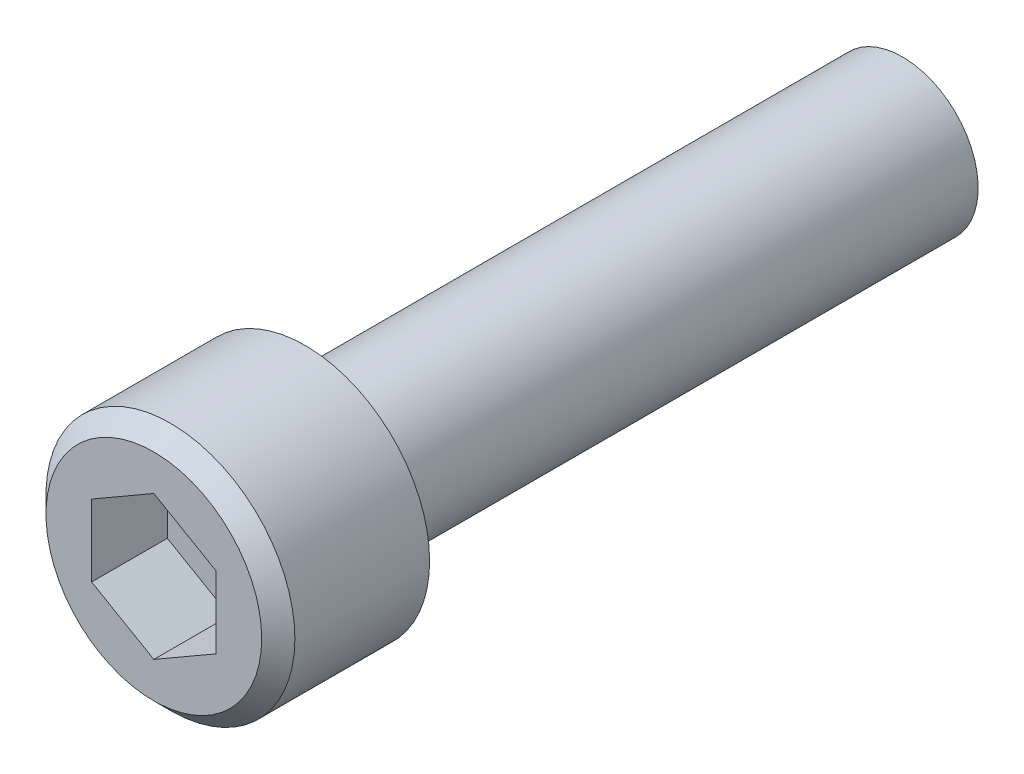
ISO-10303-21;
HEADER;
FILE_DESCRIPTION(('STEP AP214'),'2;1');
FILE_NAME('part.step','',(''),(''),'','','');
FILE_SCHEMA(('AUTOMOTIVE_DESIGN { 1 0 10303 214 1 1 1 1 }'));
ENDSEC;
DATA;
#1=APPLICATION_CONTEXT('core data for automotive mechanical design processes');
#2=APPLICATION_PROTOCOL_DEFINITION('international standard','automotive_design',2000,#1);
#3=PRODUCT_CONTEXT('',#1,'mechanical');
#4=PRODUCT('Part','Part','',(#3));
#5=PRODUCT_RELATED_PRODUCT_CATEGORY('part','',(#4));
#6=PRODUCT_DEFINITION_FORMATION('','',#4);
#7=PRODUCT_DEFINITION_CONTEXT('part definition',#1,'design');
#8=PRODUCT_DEFINITION('design','',#6,#7);
#9=PRODUCT_DEFINITION_SHAPE('','',#8);
#10=(LENGTH_UNIT() NAMED_UNIT(*) SI_UNIT(.MILLI.,.METRE.));
#11=(NAMED_UNIT(*) PLANE_ANGLE_UNIT() SI_UNIT($,.RADIAN.));
#12=(NAMED_UNIT(*) SI_UNIT($,.STERADIAN.) SOLID_ANGLE_UNIT());
#13=UNCERTAINTY_MEASURE_WITH_UNIT(LENGTH_MEASURE(1.E-05),#10,'distance_accuracy_value','');
#14=(GEOMETRIC_REPRESENTATION_CONTEXT(3) GLOBAL_UNCERTAINTY_ASSIGNED_CONTEXT((#13)) GLOBAL_UNIT_ASSIGNED_CONTEXT((#10,
#11,#12)) REPRESENTATION_CONTEXT('',''));
#15=CARTESIAN_POINT('',(0.,0.,0.));
#16=DIRECTION('',(0.,0.,1.));
#17=DIRECTION('',(1.,0.,0.));
#18=AXIS2_PLACEMENT_3D('',#15,#16,#17);
#19=CARTESIAN_POINT('',(0.,0.,19.05));
#20=DIRECTION('',(0.,0.,-1.));
#21=DIRECTION('',(-1.,0.,0.));
#22=AXIS2_PLACEMENT_3D('',#19,#20,#21);
#23=CYLINDRICAL_SURFACE('',#22,2.413);
#24=CARTESIAN_POINT('',(0.,0.,18.6944));
#25=DIRECTION('',(0.,0.,1.));
#26=DIRECTION('',(1.,0.,0.));
#27=AXIS2_PLACEMENT_3D('',#24,#25,#26);
#28=CIRCLE('',#27,2.413);
#29=CARTESIAN_POINT('',(-2.413,0.,18.6944));
#30=VERTEX_POINT('',#29);
#31=EDGE_CURVE('E149',#30,#30,#28,.F.);
#32=CARTESIAN_POINT('',(0.,0.,0.));
#33=DIRECTION('',(0.,0.,1.));
#34=DIRECTION('',(1.,0.,0.));
#35=AXIS2_PLACEMENT_3D('',#32,#33,#34);
#36=CIRCLE('',#35,2.413);
#37=CARTESIAN_POINT('',(-2.413,0.,0.));
#38=VERTEX_POINT('',#37);
#39=EDGE_CURVE('E143',#38,#38,#36,.T.);
#40=CARTESIAN_POINT('',(-2.413,0.,18.6944));
#41=CARTESIAN_POINT('',(-2.413,0.,18.4996666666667));
#42=CARTESIAN_POINT('',(-2.413,0.,18.3049333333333));
#43=CARTESIAN_POINT('',(-2.413,0.,17.9154666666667));
#44=CARTESIAN_POINT('',(-2.413,0.,17.7207333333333));
#45=CARTESIAN_POINT('',(-2.413,0.,17.3312666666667));
#46=CARTESIAN_POINT('',(-2.413,0.,17.1365333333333));
#47=CARTESIAN_POINT('',(-2.413,0.,16.7470666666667));
#48=CARTESIAN_POINT('',(-2.413,0.,16.5523333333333));
#49=CARTESIAN_POINT('',(-2.413,0.,16.1628666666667));
#50=CARTESIAN_POINT('',(-2.413,0.,15.9681333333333));
#51=CARTESIAN_POINT('',(-2.413,0.,15.5786666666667));
#52=CARTESIAN_POINT('',(-2.413,0.,15.3839333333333));
#53=CARTESIAN_POINT('',(-2.413,0.,14.9944666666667));
#54=CARTESIAN_POINT('',(-2.413,0.,14.7997333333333));
#55=CARTESIAN_POINT('',(-2.413,0.,14.4102666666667));
#56=CARTESIAN_POINT('',(-2.413,0.,14.2155333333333));
#57=CARTESIAN_POINT('',(-2.413,0.,13.8260666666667));
#58=CARTESIAN_POINT('',(-2.413,0.,13.6313333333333));
#59=CARTESIAN_POINT('',(-2.413,0.,13.2418666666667));
#60=CARTESIAN_POINT('',(-2.413,0.,13.0471333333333));
#61=CARTESIAN_POINT('',(-2.413,0.,12.6576666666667));
#62=CARTESIAN_POINT('',(-2.413,0.,12.4629333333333));
#63=CARTESIAN_POINT('',(-2.413,0.,12.0734666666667));
#64=CARTESIAN_POINT('',(-2.413,0.,11.8787333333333));
#65=CARTESIAN_POINT('',(-2.413,0.,11.4892666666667));
#66=CARTESIAN_POINT('',(-2.413,0.,11.2945333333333));
#67=CARTESIAN_POINT('',(-2.413,0.,10.9050666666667));
#68=CARTESIAN_POINT('',(-2.413,0.,10.7103333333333));
#69=CARTESIAN_POINT('',(-2.413,0.,10.3208666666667));
#70=CARTESIAN_POINT('',(-2.413,0.,10.1261333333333));
#71=CARTESIAN_POINT('',(-2.413,0.,9.73666666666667));
#72=CARTESIAN_POINT('',(-2.413,0.,9.54193333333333));
#73=CARTESIAN_POINT('',(-2.413,0.,9.15246666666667));
#74=CARTESIAN_POINT('',(-2.413,0.,8.95773333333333));
#75=CARTESIAN_POINT('',(-2.413,0.,8.56826666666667));
#76=CARTESIAN_POINT('',(-2.413,0.,8.37353333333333));
#77=CARTESIAN_POINT('',(-2.413,0.,7.98406666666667));
#78=CARTESIAN_POINT('',(-2.413,0.,7.78933333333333));
#79=CARTESIAN_POINT('',(-2.413,0.,7.39986666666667));
#80=CARTESIAN_POINT('',(-2.413,0.,7.20513333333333));
#81=CARTESIAN_POINT('',(-2.413,0.,6.81566666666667));
#82=CARTESIAN_POINT('',(-2.413,0.,6.62093333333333));
#83=CARTESIAN_POINT('',(-2.413,0.,6.23146666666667));
#84=CARTESIAN_POINT('',(-2.413,0.,6.03673333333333));
#85=CARTESIAN_POINT('',(-2.413,0.,5.64726666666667));
#86=CARTESIAN_POINT('',(-2.413,0.,5.45253333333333));
#87=CARTESIAN_POINT('',(-2.413,0.,5.06306666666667));
#88=CARTESIAN_POINT('',(-2.413,0.,4.86833333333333));
#89=CARTESIAN_POINT('',(-2.413,0.,4.47886666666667));
#90=CARTESIAN_POINT('',(-2.413,0.,4.28413333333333));
#91=CARTESIAN_POINT('',(-2.413,0.,3.89466666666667));
#92=CARTESIAN_POINT('',(-2.413,0.,3.69993333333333));
#93=CARTESIAN_POINT('',(-2.413,0.,3.31046666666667));
#94=CARTESIAN_POINT('',(-2.413,0.,3.11573333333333));
#95=CARTESIAN_POINT('',(-2.413,0.,2.72626666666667));
#96=CARTESIAN_POINT('',(-2.413,0.,2.53153333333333));
#97=CARTESIAN_POINT('',(-2.413,0.,2.14206666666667));
#98=CARTESIAN_POINT('',(-2.413,0.,1.94733333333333));
#99=CARTESIAN_POINT('',(-2.413,0.,1.55786666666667));
#100=CARTESIAN_POINT('',(-2.413,0.,1.36313333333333));
#101=CARTESIAN_POINT('',(-2.413,0.,0.973666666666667));
#102=CARTESIAN_POINT('',(-2.413,0.,0.778933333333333));
#103=CARTESIAN_POINT('',(-2.413,0.,0.389466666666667));
#104=CARTESIAN_POINT('',(-2.413,0.,0.194733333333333));
#105=CARTESIAN_POINT('',(-2.413,0.,0.));
#106=B_SPLINE_CURVE_WITH_KNOTS('',3,(#40,#41,#42,#43,#44,#45,#46,#47,#48,#49,#50,#51,#52,#53,
#54,#55,#56,#57,#58,#59,#60,#61,#62,#63,#64,#65,#66,#67,#68,#69,#70,#71,#72,#73,#74,#75,#76,#77,
#78,#79,#80,#81,#82,#83,#84,#85,#86,#87,#88,#89,#90,#91,#92,#93,#94,#95,#96,#97,#98,#99,#100,
#101,#102,#103,#104,#105),.UNSPECIFIED.,.F.,.F.,(4,2,2,2,2,2,2,2,2,2,2,2,2,2,2,2,2,2,2,2,2,2,2,
2,2,2,2,2,2,2,2,2,4),(0.,0.584199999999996,1.1684,1.7526,2.3368,2.921,3.5052,4.0894,4.6736,
5.2578,5.842,6.4262,7.0104,7.5946,8.1788,8.763,9.3472,9.9314,10.5156,11.0998,11.684,12.2682,
12.8524,13.4366,14.0208,14.605,15.1892,15.7734,16.3576,16.9418,17.526,18.1102,18.6944),.UNSPECIFIED.);
#107=EDGE_CURVE('BSEAM36',#30,#38,#106,.T.);
#108=ORIENTED_EDGE('',*,*,#31,.T.);
#109=ORIENTED_EDGE('',*,*,#39,.T.);
#110=ORIENTED_EDGE('',*,*,#107,.T.);
#111=ORIENTED_EDGE('',*,*,#107,.F.);
#112=EDGE_LOOP('',(#108,#110,#109,#111));
#113=FACE_BOUND('',#112,.T.);
#114=ADVANCED_FACE('F36',(#113),#23,.T.);
#115=CARTESIAN_POINT('',(0.,0.,0.));
#116=DIRECTION('',(0.,0.,1.));
#117=DIRECTION('',(1.,0.,0.));
#118=AXIS2_PLACEMENT_3D('',#115,#116,#117);
#119=PLANE('',#118);
#120=ORIENTED_EDGE('',*,*,#39,.F.);
#121=EDGE_LOOP('',(#120));
#122=FACE_BOUND('',#121,.T.);
#123=ADVANCED_FACE('F167',(#122),#119,.F.);
#124=CARTESIAN_POINT('',(0.,0.,19.05));
#125=DIRECTION('',(0.,0.,1.));
#126=DIRECTION('',(1.,0.,0.));
#127=AXIS2_PLACEMENT_3D('',#124,#125,#126);
#128=PLANE('',#127);
#129=CARTESIAN_POINT('',(0.,0.,19.05));
#130=DIRECTION('',(0.,0.,1.));
#131=DIRECTION('',(1.,0.,0.));
#132=AXIS2_PLACEMENT_3D('',#129,#130,#131);
#133=CIRCLE('',#132,2.7686);
#134=CARTESIAN_POINT('',(2.7686,0.,19.05));
#135=VERTEX_POINT('',#134);
#136=EDGE_CURVE('E146',#135,#135,#133,.T.);
#137=ORIENTED_EDGE('',*,*,#136,.T.);
#138=EDGE_LOOP('',(#137));
#139=FACE_BOUND('',#138,.T.);
#140=CARTESIAN_POINT('',(0.,0.,19.05));
#141=DIRECTION('',(0.,0.,1.));
#142=DIRECTION('',(1.,0.,0.));
#143=AXIS2_PLACEMENT_3D('',#140,#141,#142);
#144=CIRCLE('',#143,3.96875);
#145=CARTESIAN_POINT('',(3.96875,0.,19.05));
#146=VERTEX_POINT('',#145);
#147=EDGE_CURVE('E134',#146,#146,#144,.T.);
#148=ORIENTED_EDGE('',*,*,#147,.F.);
#149=EDGE_LOOP('',(#148));
#150=FACE_BOUND('',#149,.T.);
#151=ADVANCED_FACE('F172',(#139,#150),#128,.F.);
#152=CARTESIAN_POINT('',(0.,0.,23.876));
#153=DIRECTION('',(0.,0.,-1.));
#154=DIRECTION('',(-1.,0.,0.));
#155=AXIS2_PLACEMENT_3D('',#152,#153,#154);
#156=CYLINDRICAL_SURFACE('',#155,3.96875);
#157=CARTESIAN_POINT('',(0.,0.,23.3468333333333));
#158=DIRECTION('',(0.,0.,1.));
#159=DIRECTION('',(1.,0.,0.));
#160=AXIS2_PLACEMENT_3D('',#157,#158,#159);
#161=CIRCLE('',#160,3.96875);
#162=CARTESIAN_POINT('',(3.96875,0.,23.3468333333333));
#163=VERTEX_POINT('',#162);
#164=EDGE_CURVE('E11',#163,#163,#161,.F.);
#165=ORIENTED_EDGE('',*,*,#164,.T.);
#166=EDGE_LOOP('',(#165));
#167=FACE_BOUND('',#166,.T.);
#168=ORIENTED_EDGE('',*,*,#147,.T.);
#169=EDGE_LOOP('',(#168));
#170=FACE_BOUND('',#169,.T.);
#171=ADVANCED_FACE('F187',(#167,#170),#156,.T.);
#172=CARTESIAN_POINT('',(0.,0.,23.876));
#173=DIRECTION('',(0.,0.,1.));
#174=DIRECTION('',(1.,0.,0.));
#175=AXIS2_PLACEMENT_3D('',#172,#173,#174);
#176=PLANE('',#175);
#177=CARTESIAN_POINT('',(0.,0.,23.876));
#178=DIRECTION('',(0.,0.,1.));
#179=DIRECTION('',(1.,0.,0.));
#180=AXIS2_PLACEMENT_3D('',#177,#178,#179);
#181=CIRCLE('',#180,3.43958333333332);
#182=CARTESIAN_POINT('',(3.43958333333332,0.,23.876));
#183=VERTEX_POINT('',#182);
#184=EDGE_CURVE('E43',#183,#183,#181,.T.);
#185=ORIENTED_EDGE('',*,*,#184,.T.);
#186=EDGE_LOOP('',(#185));
#187=FACE_BOUND('',#186,.T.);
#188=DIRECTION('',(-0.866025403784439,-0.499999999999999,0.));
#189=VECTOR('',#188,1.);
#190=CARTESIAN_POINT('',(0.,2.29135888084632,23.8760000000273));
#191=LINE('',#190,#189);
#192=CARTESIAN_POINT('',(0.,2.29135888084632,23.8760000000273));
#193=VERTEX_POINT('',#192);
#194=CARTESIAN_POINT('',(-1.984375,1.14567944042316,23.876));
#195=VERTEX_POINT('',#194);
#196=EDGE_CURVE('E50',#193,#195,#191,.T.);
#197=ORIENTED_EDGE('',*,*,#196,.F.);
#198=DIRECTION('',(0.866025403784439,-0.499999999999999,0.));
#199=VECTOR('',#198,1.);
#200=CARTESIAN_POINT('',(0.,2.29135888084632,23.8760000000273));
#201=LINE('',#200,#199);
#202=CARTESIAN_POINT('',(1.984375,1.14567944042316,23.8760000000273));
#203=VERTEX_POINT('',#202);
#204=EDGE_CURVE('E117',#193,#203,#201,.T.);
#205=ORIENTED_EDGE('',*,*,#204,.T.);
#206=DIRECTION('',(0.,-1.,0.));
#207=VECTOR('',#206,1.);
#208=CARTESIAN_POINT('',(1.984375,1.14567944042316,23.8760000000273));
#209=LINE('',#208,#207);
#210=CARTESIAN_POINT('',(1.984375,-1.14567944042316,23.8760000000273));
#211=VERTEX_POINT('',#210);
#212=EDGE_CURVE('E112',#203,#211,#209,.T.);
#213=ORIENTED_EDGE('',*,*,#212,.T.);
#214=DIRECTION('',(0.86602540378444,0.499999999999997,0.));
#215=VECTOR('',#214,1.);
#216=CARTESIAN_POINT('',(0.,-2.29135888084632,23.8760000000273));
#217=LINE('',#216,#215);
#218=CARTESIAN_POINT('',(0.,-2.29135888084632,23.8760000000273));
#219=VERTEX_POINT('',#218);
#220=EDGE_CURVE('E110',#219,#211,#217,.T.);
#221=ORIENTED_EDGE('',*,*,#220,.F.);
#222=DIRECTION('',(-0.86602540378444,0.499999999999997,0.));
#223=VECTOR('',#222,1.);
#224=CARTESIAN_POINT('',(0.,-2.29135888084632,23.8760000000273));
#225=LINE('',#224,#223);
#226=CARTESIAN_POINT('',(-1.984375,-1.14567944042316,23.8760000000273));
#227=VERTEX_POINT('',#226);
#228=EDGE_CURVE('E92',#219,#227,#225,.T.);
#229=ORIENTED_EDGE('',*,*,#228,.T.);
#230=DIRECTION('',(0.,-1.,0.));
#231=VECTOR('',#230,1.);
#232=CARTESIAN_POINT('',(-1.984375,1.14567944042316,23.8760000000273));
#233=LINE('',#232,#231);
#234=EDGE_CURVE('E103',#195,#227,#233,.T.);
#235=ORIENTED_EDGE('',*,*,#234,.F.);
#236=EDGE_LOOP('',(#197,#205,#213,#221,#229,#235));
#237=FACE_BOUND('',#236,.T.);
#238=ADVANCED_FACE('F107',(#187,#237),#176,.T.);
#239=CARTESIAN_POINT('',(0.,0.,18.6944));
#240=DIRECTION('',(0.,0.,1.));
#241=DIRECTION('',(1.,0.,0.));
#242=AXIS2_PLACEMENT_3D('',#239,#240,#241);
#243=TOROIDAL_SURFACE('',#242,2.7686,0.3556);
#244=ORIENTED_EDGE('',*,*,#31,.F.);
#245=EDGE_LOOP('',(#244));
#246=FACE_BOUND('',#245,.T.);
#247=ORIENTED_EDGE('',*,*,#136,.F.);
#248=EDGE_LOOP('',(#247));
#249=FACE_BOUND('',#248,.T.);
#250=ADVANCED_FACE('F178',(#246,#249),#243,.F.);
#251=CARTESIAN_POINT('',(0.,2.29135888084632,21.4630000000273));
#252=DIRECTION('',(-0.499999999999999,0.866025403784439,0.));
#253=DIRECTION('',(-0.866025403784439,-0.499999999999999,0.));
#254=AXIS2_PLACEMENT_3D('',#251,#252,#253);
#255=PLANE('',#254);
#256=ORIENTED_EDGE('',*,*,#196,.T.);
#257=DIRECTION('',(0.,0.,1.));
#258=VECTOR('',#257,1.);
#259=CARTESIAN_POINT('',(-1.984375,1.14567944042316,21.4630000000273));
#260=LINE('',#259,#258);
#261=CARTESIAN_POINT('',(-1.984375,1.14567944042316,21.4630000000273));
#262=VERTEX_POINT('',#261);
#263=EDGE_CURVE('E100',#262,#195,#260,.T.);
#264=ORIENTED_EDGE('',*,*,#263,.F.);
#265=DIRECTION('',(-0.866025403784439,-0.499999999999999,0.));
#266=VECTOR('',#265,1.);
#267=CARTESIAN_POINT('',(0.,2.29135888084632,21.4630000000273));
#268=LINE('',#267,#266);
#269=CARTESIAN_POINT('',(0.,2.29135888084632,21.4630000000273));
#270=VERTEX_POINT('',#269);
#271=EDGE_CURVE('E120',#270,#262,#268,.T.);
#272=ORIENTED_EDGE('',*,*,#271,.F.);
#273=DIRECTION('',(0.,0.,1.));
#274=VECTOR('',#273,1.);
#275=CARTESIAN_POINT('',(0.,2.29135888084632,21.4630000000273));
#276=LINE('',#275,#274);
#277=EDGE_CURVE('E57',#270,#193,#276,.T.);
#278=ORIENTED_EDGE('',*,*,#277,.T.);
#279=EDGE_LOOP('',(#256,#264,#272,#278));
#280=FACE_BOUND('',#279,.T.);
#281=ADVANCED_FACE('F181',(#280),#255,.F.);
#282=CARTESIAN_POINT('',(0.,2.29135888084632,21.4630000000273));
#283=DIRECTION('',(-0.499999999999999,-0.866025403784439,0.));
#284=DIRECTION('',(0.866025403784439,-0.499999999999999,0.));
#285=AXIS2_PLACEMENT_3D('',#282,#283,#284);
#286=PLANE('',#285);
#287=ORIENTED_EDGE('',*,*,#204,.F.);
#288=ORIENTED_EDGE('',*,*,#277,.F.);
#289=DIRECTION('',(0.866025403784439,-0.499999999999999,0.));
#290=VECTOR('',#289,1.);
#291=CARTESIAN_POINT('',(0.,2.29135888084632,21.4630000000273));
#292=LINE('',#291,#290);
#293=CARTESIAN_POINT('',(1.984375,1.14567944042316,21.4630000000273));
#294=VERTEX_POINT('',#293);
#295=EDGE_CURVE('E131',#270,#294,#292,.T.);
#296=ORIENTED_EDGE('',*,*,#295,.T.);
#297=DIRECTION('',(0.,0.,1.));
#298=VECTOR('',#297,1.);
#299=CARTESIAN_POINT('',(1.984375,1.14567944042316,21.4630000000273));
#300=LINE('',#299,#298);
#301=EDGE_CURVE('E135',#294,#203,#300,.T.);
#302=ORIENTED_EDGE('',*,*,#301,.T.);
#303=EDGE_LOOP('',(#287,#288,#296,#302));
#304=FACE_BOUND('',#303,.T.);
#305=ADVANCED_FACE('F201',(#304),#286,.T.);
#306=CARTESIAN_POINT('',(1.984375,1.14567944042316,21.4630000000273));
#307=DIRECTION('',(-1.,0.,0.));
#308=DIRECTION('',(0.,0.,1.));
#309=AXIS2_PLACEMENT_3D('',#306,#307,#308);
#310=PLANE('',#309);
#311=ORIENTED_EDGE('',*,*,#212,.F.);
#312=ORIENTED_EDGE('',*,*,#301,.F.);
#313=DIRECTION('',(0.,-1.,0.));
#314=VECTOR('',#313,1.);
#315=CARTESIAN_POINT('',(1.984375,1.14567944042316,21.4630000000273));
#316=LINE('',#315,#314);
#317=CARTESIAN_POINT('',(1.984375,-1.14567944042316,21.4630000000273));
#318=VERTEX_POINT('',#317);
#319=EDGE_CURVE('E129',#294,#318,#316,.T.);
#320=ORIENTED_EDGE('',*,*,#319,.T.);
#321=DIRECTION('',(0.,0.,1.));
#322=VECTOR('',#321,1.);
#323=CARTESIAN_POINT('',(1.984375,-1.14567944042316,21.4630000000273));
#324=LINE('',#323,#322);
#325=EDGE_CURVE('E137',#318,#211,#324,.T.);
#326=ORIENTED_EDGE('',*,*,#325,.T.);
#327=EDGE_LOOP('',(#311,#312,#320,#326));
#328=FACE_BOUND('',#327,.T.);
#329=ADVANCED_FACE('F209',(#328),#310,.T.);
#330=CARTESIAN_POINT('',(0.,-2.29135888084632,21.4630000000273));
#331=DIRECTION('',(0.499999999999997,-0.86602540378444,0.));
#332=DIRECTION('',(0.86602540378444,0.499999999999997,0.));
#333=AXIS2_PLACEMENT_3D('',#330,#331,#332);
#334=PLANE('',#333);
#335=ORIENTED_EDGE('',*,*,#220,.T.);
#336=ORIENTED_EDGE('',*,*,#325,.F.);
#337=DIRECTION('',(0.86602540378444,0.499999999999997,0.));
#338=VECTOR('',#337,1.);
#339=CARTESIAN_POINT('',(0.,-2.29135888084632,21.4630000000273));
#340=LINE('',#339,#338);
#341=CARTESIAN_POINT('',(0.,-2.29135888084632,21.4630000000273));
#342=VERTEX_POINT('',#341);
#343=EDGE_CURVE('E126',#342,#318,#340,.T.);
#344=ORIENTED_EDGE('',*,*,#343,.F.);
#345=DIRECTION('',(0.,0.,1.));
#346=VECTOR('',#345,1.);
#347=CARTESIAN_POINT('',(0.,-2.29135888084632,21.4630000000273));
#348=LINE('',#347,#346);
#349=EDGE_CURVE('E99',#342,#219,#348,.T.);
#350=ORIENTED_EDGE('',*,*,#349,.T.);
#351=EDGE_LOOP('',(#335,#336,#344,#350));
#352=FACE_BOUND('',#351,.T.);
#353=ADVANCED_FACE('F206',(#352),#334,.F.);
#354=CARTESIAN_POINT('',(0.,-2.29135888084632,21.4630000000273));
#355=DIRECTION('',(0.499999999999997,0.86602540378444,0.));
#356=DIRECTION('',(-0.86602540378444,0.499999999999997,0.));
#357=AXIS2_PLACEMENT_3D('',#354,#355,#356);
#358=PLANE('',#357);
#359=ORIENTED_EDGE('',*,*,#228,.F.);
#360=ORIENTED_EDGE('',*,*,#349,.F.);
#361=DIRECTION('',(-0.86602540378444,0.499999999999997,0.));
#362=VECTOR('',#361,1.);
#363=CARTESIAN_POINT('',(0.,-2.29135888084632,21.4630000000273));
#364=LINE('',#363,#362);
#365=CARTESIAN_POINT('',(-1.984375,-1.14567944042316,21.4630000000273));
#366=VERTEX_POINT('',#365);
#367=EDGE_CURVE('E95',#342,#366,#364,.T.);
#368=ORIENTED_EDGE('',*,*,#367,.T.);
#369=DIRECTION('',(0.,0.,1.));
#370=VECTOR('',#369,1.);
#371=CARTESIAN_POINT('',(-1.984375,-1.14567944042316,21.4630000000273));
#372=LINE('',#371,#370);
#373=EDGE_CURVE('E88',#366,#227,#372,.T.);
#374=ORIENTED_EDGE('',*,*,#373,.T.);
#375=EDGE_LOOP('',(#359,#360,#368,#374));
#376=FACE_BOUND('',#375,.T.);
#377=ADVANCED_FACE('F90',(#376),#358,.T.);
#378=CARTESIAN_POINT('',(-1.984375,1.14567944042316,21.4630000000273));
#379=DIRECTION('',(-1.,0.,0.));
#380=DIRECTION('',(0.,0.,1.));
#381=AXIS2_PLACEMENT_3D('',#378,#379,#380);
#382=PLANE('',#381);
#383=ORIENTED_EDGE('',*,*,#234,.T.);
#384=ORIENTED_EDGE('',*,*,#373,.F.);
#385=DIRECTION('',(0.,-1.,0.));
#386=VECTOR('',#385,1.);
#387=CARTESIAN_POINT('',(-1.984375,1.14567944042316,21.4630000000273));
#388=LINE('',#387,#386);
#389=EDGE_CURVE('E123',#262,#366,#388,.T.);
#390=ORIENTED_EDGE('',*,*,#389,.F.);
#391=ORIENTED_EDGE('',*,*,#263,.T.);
#392=EDGE_LOOP('',(#383,#384,#390,#391));
#393=FACE_BOUND('',#392,.T.);
#394=ADVANCED_FACE('F104',(#393),#382,.F.);
#395=CARTESIAN_POINT('',(-1.984375,1.14567944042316,21.4630000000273));
#396=DIRECTION('',(0.,0.,1.));
#397=DIRECTION('',(1.,0.,0.));
#398=AXIS2_PLACEMENT_3D('',#395,#396,#397);
#399=PLANE('',#398);
#400=ORIENTED_EDGE('',*,*,#271,.T.);
#401=ORIENTED_EDGE('',*,*,#389,.T.);
#402=ORIENTED_EDGE('',*,*,#367,.F.);
#403=ORIENTED_EDGE('',*,*,#343,.T.);
#404=ORIENTED_EDGE('',*,*,#319,.F.);
#405=ORIENTED_EDGE('',*,*,#295,.F.);
#406=EDGE_LOOP('',(#400,#401,#402,#403,#404,#405));
#407=FACE_BOUND('',#406,.T.);
#408=ADVANCED_FACE('F157',(#407),#399,.T.);
#409=CARTESIAN_POINT('',(0.,0.,23.876));
#410=DIRECTION('',(0.,0.,-1.));
#411=DIRECTION('',(-1.,0.,0.));
#412=AXIS2_PLACEMENT_3D('',#409,#410,#411);
#413=CONICAL_SURFACE('',#412,3.43958333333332,0.785398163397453);
#414=ORIENTED_EDGE('',*,*,#164,.F.);
#415=EDGE_LOOP('',(#414));
#416=FACE_BOUND('',#415,.T.);
#417=ORIENTED_EDGE('',*,*,#184,.F.);
#418=EDGE_LOOP('',(#417));
#419=FACE_BOUND('',#418,.T.);
#420=ADVANCED_FACE('F155',(#416,#419),#413,.T.);
#421=CLOSED_SHELL('',(#114,#123,#151,#171,#238,#250,#281,#305,#329,#353,#377,#394,#408,#420));
#422=MANIFOLD_SOLID_BREP('B2',#421);
#423=ADVANCED_BREP_SHAPE_REPRESENTATION('',(#18,#422),#14);
#424=SHAPE_DEFINITION_REPRESENTATION(#9,#423);
ENDSEC;
END-ISO-10303-21;
